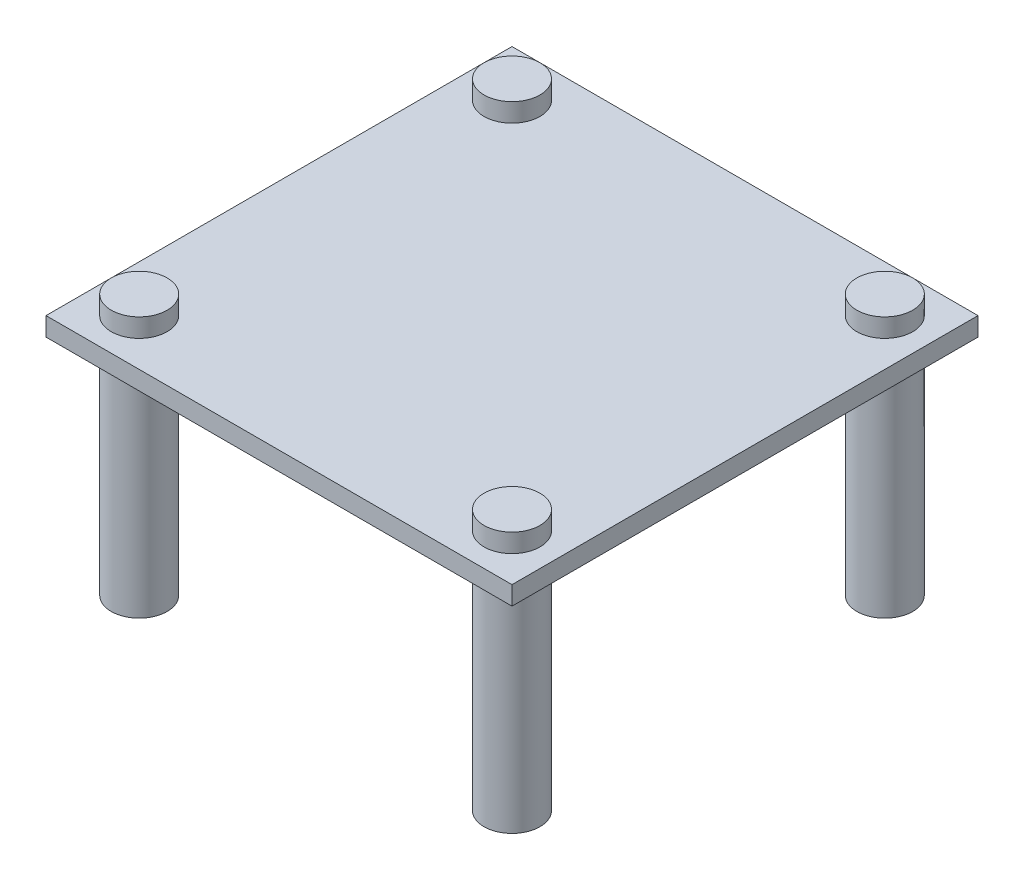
from build123d import *

# Parameters (mm, degrees)
ESQUISSE1_W        = 250
ESQUISSE1_H        = 250
BOSS_EXTRU_1_DEPTH = 10
ESQUISSE2_R        = 15
BOSS_EXTRU_2_DEPTH = 120
BOSS_EXTRU_3_START = -20
ESQUISSE3_R        = 15
BOSS_EXTRU_3_DEPTH = 20


with BuildPart() as part:
    # Esquisse1 → Boss.-Extru.1 (new body)
    with BuildSketch(Plane(origin=(0, 0, 0), x_dir=(1, 0, 0), z_dir=(0, 1, 0))):
        with Locations((125, 125)):
            Rectangle(ESQUISSE1_W, ESQUISSE1_H)
    extrude(amount=BOSS_EXTRU_1_DEPTH)

    # Esquisse2 → Boss.-Extru.2 (add)
    with BuildSketch(Plane(origin=(0, 0, 0), x_dir=(-1, 0, 0), z_dir=(0, -1, 0))):
        with Locations(Location((-25, 225, 0), (0, 0, 90))):
            Circle(ESQUISSE2_R)
        with Locations(Location((-225, 225, 0), (0, 0, 90))):
            Circle(ESQUISSE2_R)
        with Locations(Location((-25, 25, 0), (0, 0, 90))):
            Circle(ESQUISSE2_R)
        with Locations(Location((-225, 25, 0), (0, 0, 90))):
            Circle(ESQUISSE2_R)
    extrude(amount=BOSS_EXTRU_2_DEPTH)

    # Esquisse3 → Boss.-Extru.3 (add)
    with BuildSketch(Plane(origin=(0, 0, 0), x_dir=(-1, 0, 0), z_dir=(0, -1, 0)).offset(BOSS_EXTRU_3_START)):
        with Locations(Location((-25, 225, 0), (0, 0, 90))):
            Circle(ESQUISSE3_R)
        with Locations(Location((-225, 225, 0), (0, 0, 90))):
            Circle(ESQUISSE3_R)
        with Locations(Location((-25, 25, 0), (0, 0, 90))):
            Circle(ESQUISSE3_R)
        with Locations(Location((-225, 25, 0), (0, 0, 90))):
            Circle(ESQUISSE3_R)
    extrude(amount=BOSS_EXTRU_3_DEPTH)


solid = part.part
